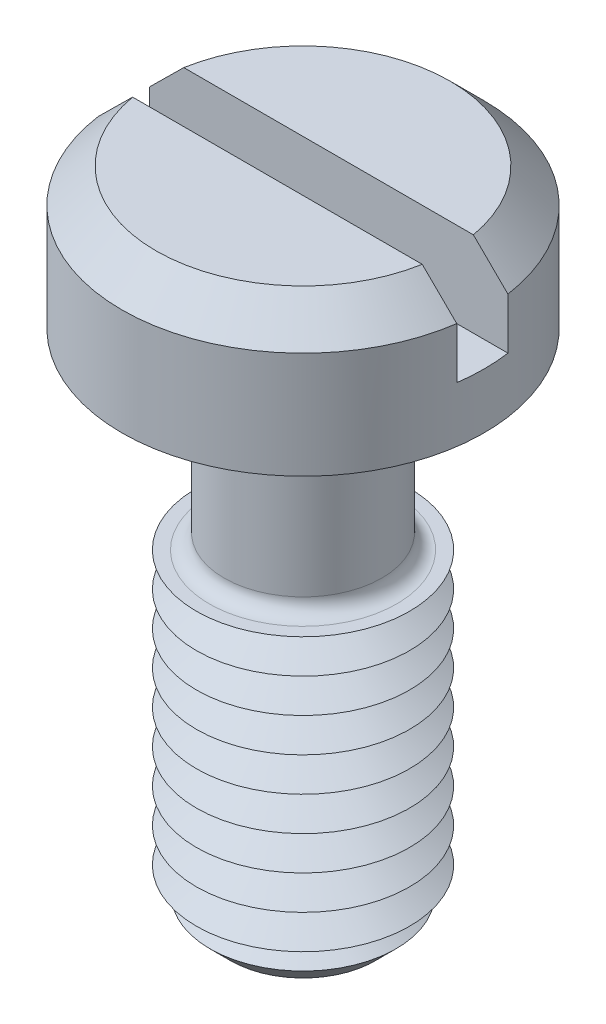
ISO-10303-21;
HEADER;
FILE_DESCRIPTION(('STEP AP214'),'2;1');
FILE_NAME('part.step','',(''),(''),'','','');
FILE_SCHEMA(('AUTOMOTIVE_DESIGN { 1 0 10303 214 1 1 1 1 }'));
ENDSEC;
DATA;
#1=APPLICATION_CONTEXT('core data for automotive mechanical design processes');
#2=APPLICATION_PROTOCOL_DEFINITION('international standard','automotive_design',2000,#1);
#3=PRODUCT_CONTEXT('',#1,'mechanical');
#4=PRODUCT('Part','Part','',(#3));
#5=PRODUCT_RELATED_PRODUCT_CATEGORY('part','',(#4));
#6=PRODUCT_DEFINITION_FORMATION('','',#4);
#7=PRODUCT_DEFINITION_CONTEXT('part definition',#1,'design');
#8=PRODUCT_DEFINITION('design','',#6,#7);
#9=PRODUCT_DEFINITION_SHAPE('','',#8);
#10=(LENGTH_UNIT() NAMED_UNIT(*) SI_UNIT(.MILLI.,.METRE.));
#11=(NAMED_UNIT(*) PLANE_ANGLE_UNIT() SI_UNIT($,.RADIAN.));
#12=(NAMED_UNIT(*) SI_UNIT($,.STERADIAN.) SOLID_ANGLE_UNIT());
#13=UNCERTAINTY_MEASURE_WITH_UNIT(LENGTH_MEASURE(1.E-05),#10,'distance_accuracy_value','');
#14=(GEOMETRIC_REPRESENTATION_CONTEXT(3) GLOBAL_UNCERTAINTY_ASSIGNED_CONTEXT((#13)) GLOBAL_UNIT_ASSIGNED_CONTEXT((#10,
#11,#12)) REPRESENTATION_CONTEXT('',''));
#15=CARTESIAN_POINT('',(0.,0.,0.));
#16=DIRECTION('',(0.,0.,1.));
#17=DIRECTION('',(1.,0.,0.));
#18=AXIS2_PLACEMENT_3D('',#15,#16,#17);
#19=CARTESIAN_POINT('',(0.,3.3,0.));
#20=DIRECTION('',(0.,1.,0.));
#21=DIRECTION('',(0.,0.,1.));
#22=AXIS2_PLACEMENT_3D('',#19,#20,#21);
#23=PLANE('',#22);
#24=DIRECTION('',(-1.,0.,0.));
#25=VECTOR('',#24,1.);
#26=CARTESIAN_POINT('',(4.25,3.3,-0.6));
#27=LINE('',#26,#25);
#28=CARTESIAN_POINT('',(3.39742549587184,3.3,-0.6));
#29=VERTEX_POINT('',#28);
#30=CARTESIAN_POINT('',(-3.39742549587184,3.3,-0.6));
#31=VERTEX_POINT('',#30);
#32=EDGE_CURVE('E110',#29,#31,#27,.T.);
#33=ORIENTED_EDGE('',*,*,#32,.F.);
#34=CARTESIAN_POINT('',(0.,3.3,0.));
#35=DIRECTION('',(0.,1.,0.));
#36=DIRECTION('',(0.,0.,1.));
#37=AXIS2_PLACEMENT_3D('',#34,#35,#36);
#38=CIRCLE('',#37,3.45);
#39=EDGE_CURVE('E113',#29,#31,#38,.T.);
#40=ORIENTED_EDGE('',*,*,#39,.T.);
#41=EDGE_LOOP('',(#33,#40));
#42=FACE_BOUND('',#41,.T.);
#43=ADVANCED_FACE('F39',(#42),#23,.T.);
#44=CARTESIAN_POINT('',(0.,3.3,0.));
#45=DIRECTION('',(0.,-1.,0.));
#46=DIRECTION('',(0.,0.,-1.));
#47=AXIS2_PLACEMENT_3D('',#44,#45,#46);
#48=CONICAL_SURFACE('',#47,3.45,0.785398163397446);
#49=CARTESIAN_POINT('',(9.35351408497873,-2.62273843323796,-0.6));
#50=CARTESIAN_POINT('',(9.03263557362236,-2.30252317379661,-0.6));
#51=CARTESIAN_POINT('',(8.71172811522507,-1.98233690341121,-0.6));
#52=CARTESIAN_POINT('',(8.06981262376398,-1.34205341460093,-0.6));
#53=CARTESIAN_POINT('',(7.74880458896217,-1.02195619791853,-0.6));
#54=CARTESIAN_POINT('',(7.10652460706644,-0.381761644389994,-0.6));
#55=CARTESIAN_POINT('',(6.7852526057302,-0.0616643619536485,-0.6));
#56=CARTESIAN_POINT('',(6.14251393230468,0.578323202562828,-0.6));
#57=CARTESIAN_POINT('',(5.82104726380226,0.898213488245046,-0.6));
#58=CARTESIAN_POINT('',(5.17196209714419,1.5434750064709,-0.6));
#59=CARTESIAN_POINT('',(4.84433778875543,1.86884039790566,-0.6));
#60=CARTESIAN_POINT('',(4.35244442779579,2.35644593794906,-0.6));
#61=CARTESIAN_POINT('',(4.18839924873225,2.51891187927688,-0.6));
#62=CARTESIAN_POINT('',(3.86009606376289,2.84362679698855,-0.6));
#63=CARTESIAN_POINT('',(3.69583805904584,3.0058757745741,-0.6));
#64=CARTESIAN_POINT('',(3.36705354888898,3.33001661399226,-0.6));
#65=CARTESIAN_POINT('',(3.20252712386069,3.49190855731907,-0.6));
#66=CARTESIAN_POINT('',(2.87298689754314,3.81520272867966,-0.6));
#67=CARTESIAN_POINT('',(2.70797308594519,3.97660494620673,-0.6));
#68=CARTESIAN_POINT('',(2.37716903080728,4.29858210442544,-0.6));
#69=CARTESIAN_POINT('',(2.21137886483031,4.45915712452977,-0.6));
#70=CARTESIAN_POINT('',(1.96157219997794,4.69884609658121,-0.6));
#71=CARTESIAN_POINT('',(1.87811785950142,4.77854546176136,-0.6));
#72=CARTESIAN_POINT('',(1.71066064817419,4.93736532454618,-0.6));
#73=CARTESIAN_POINT('',(1.62665778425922,5.01648582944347,-0.6));
#74=CARTESIAN_POINT('',(1.49655488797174,5.13773269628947,-0.6));
#75=CARTESIAN_POINT('',(1.45074972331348,5.18017521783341,-0.6));
#76=CARTESIAN_POINT('',(1.35882119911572,5.26471614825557,-0.6));
#77=CARTESIAN_POINT('',(1.31269783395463,5.30681455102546,-0.6));
#78=CARTESIAN_POINT('',(1.22008852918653,5.39050695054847,-0.6));
#79=CARTESIAN_POINT('',(1.17360305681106,5.43210146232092,-0.6));
#80=CARTESIAN_POINT('',(1.08007401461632,5.51465347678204,-0.6));
#81=CARTESIAN_POINT('',(1.03303046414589,5.55561100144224,-0.6));
#82=CARTESIAN_POINT('',(0.919047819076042,5.65299331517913,-0.6));
#83=CARTESIAN_POINT('',(0.851738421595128,5.7089924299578,-0.6));
#84=CARTESIAN_POINT('',(0.748806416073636,5.79068526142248,-0.6));
#85=CARTESIAN_POINT('',(0.714125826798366,5.8175621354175,-0.6));
#86=CARTESIAN_POINT('',(0.643915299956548,5.87018079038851,-0.6));
#87=CARTESIAN_POINT('',(0.608385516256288,5.89592277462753,-0.6));
#88=CARTESIAN_POINT('',(0.545162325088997,5.93955652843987,-0.6));
#89=CARTESIAN_POINT('',(0.51771851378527,5.95780799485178,-0.6));
#90=CARTESIAN_POINT('',(0.462025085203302,5.99303174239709,-0.6));
#91=CARTESIAN_POINT('',(0.433775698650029,6.01000438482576,-0.6));
#92=CARTESIAN_POINT('',(0.37634195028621,6.04213837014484,-0.6));
#93=CARTESIAN_POINT('',(0.347160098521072,6.05730412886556,-0.6));
#94=CARTESIAN_POINT('',(0.287642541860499,6.08513394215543,-0.6));
#95=CARTESIAN_POINT('',(0.257308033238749,6.09780051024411,-0.6));
#96=CARTESIAN_POINT('',(0.190863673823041,6.12124627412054,-0.6));
#97=CARTESIAN_POINT('',(0.154554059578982,6.13148571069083,-0.6));
#98=CARTESIAN_POINT('',(0.0807909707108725,6.14565404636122,-0.6));
#99=CARTESIAN_POINT('',(0.0433423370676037,6.14960664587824,-0.6));
#100=CARTESIAN_POINT('',(-0.0317987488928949,6.15033783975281,-0.6));
#101=CARTESIAN_POINT('',(-0.0694915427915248,6.14708428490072,-0.6));
#102=CARTESIAN_POINT('',(-0.143790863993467,6.13410921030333,-0.6));
#103=CARTESIAN_POINT('',(-0.180393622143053,6.12436747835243,-0.6));
#104=CARTESIAN_POINT('',(-0.254098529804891,6.09939647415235,-0.6));
#105=CARTESIAN_POINT('',(-0.291094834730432,6.08386859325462,-0.6));
#106=CARTESIAN_POINT('',(-0.363408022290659,6.04924663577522,-0.6));
#107=CARTESIAN_POINT('',(-0.398721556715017,6.03014579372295,-0.6));
#108=CARTESIAN_POINT('',(-0.468234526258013,5.98944452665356,-0.6));
#109=CARTESIAN_POINT('',(-0.50242270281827,5.96782521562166,-0.6));
#110=CARTESIAN_POINT('',(-0.569689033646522,5.92300618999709,-0.6));
#111=CARTESIAN_POINT('',(-0.602768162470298,5.89980792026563,-0.6));
#112=CARTESIAN_POINT('',(-0.671148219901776,5.85008963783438,-0.6));
#113=CARTESIAN_POINT('',(-0.706369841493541,5.82346130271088,-0.6));
#114=CARTESIAN_POINT('',(-0.776087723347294,5.76926828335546,-0.6));
#115=CARTESIAN_POINT('',(-0.810583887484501,5.74170347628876,-0.6));
#116=CARTESIAN_POINT('',(-0.913286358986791,5.65798278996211,-0.6));
#117=CARTESIAN_POINT('',(-0.980673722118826,5.60082541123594,-0.6));
#118=CARTESIAN_POINT('',(-1.11424616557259,5.48490670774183,-0.6));
#119=CARTESIAN_POINT('',(-1.18042891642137,5.42614273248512,-0.6));
#120=CARTESIAN_POINT('',(-1.31191262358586,5.30767463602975,-0.6));
#121=CARTESIAN_POINT('',(-1.37721382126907,5.24797078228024,-0.6));
#122=CARTESIAN_POINT('',(-1.50701089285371,5.12812906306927,-0.6));
#123=CARTESIAN_POINT('',(-1.57150872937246,5.06799331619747,-0.6));
#124=CARTESIAN_POINT('',(-1.70009132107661,4.94727328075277,-0.6));
#125=CARTESIAN_POINT('',(-1.76417604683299,4.88668896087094,-0.6));
#126=CARTESIAN_POINT('',(-1.95584105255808,4.70458824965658,-0.6));
#127=CARTESIAN_POINT('',(-2.08296922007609,4.5825964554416,-0.6));
#128=CARTESIAN_POINT('',(-2.33599178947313,4.33840625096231,-0.6));
#129=CARTESIAN_POINT('',(-2.4618891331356,4.21621087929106,-0.6));
#130=CARTESIAN_POINT('',(-2.71323511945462,3.97135925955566,-0.6));
#131=CARTESIAN_POINT('',(-2.83868376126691,3.84870301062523,-0.6));
#132=CARTESIAN_POINT('',(-3.21459106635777,3.48027743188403,-0.6));
#133=CARTESIAN_POINT('',(-3.46460626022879,3.23405597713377,-0.6));
#134=CARTESIAN_POINT('',(-3.96413793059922,2.74090313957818,-0.6));
#135=CARTESIAN_POINT('',(-4.21365415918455,2.49397150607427,-0.6));
#136=CARTESIAN_POINT('',(-4.71232475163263,1.99974737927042,-0.6));
#137=CARTESIAN_POINT('',(-4.96147911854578,1.75245488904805,-0.6));
#138=CARTESIAN_POINT('',(-5.45958725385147,1.25761544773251,-0.6));
#139=CARTESIAN_POINT('',(-5.70854099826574,1.01006847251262,-0.6));
#140=CARTESIAN_POINT('',(-6.20629498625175,0.514819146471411,-0.6));
#141=CARTESIAN_POINT('',(-6.45509522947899,0.26711679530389,-0.6));
#142=CARTESIAN_POINT('',(-7.20128563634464,-0.476100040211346,-0.6));
#143=CARTESIAN_POINT('',(-7.69851620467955,-0.971774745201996,-0.6));
#144=CARTESIAN_POINT('',(-8.38865115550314,-1.66007026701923,-0.6));
#145=CARTESIAN_POINT('',(-8.58165346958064,-1.85259293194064,-0.6));
#146=CARTESIAN_POINT('',(-8.87112736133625,-2.14139225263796,-0.6));
#147=CARTESIAN_POINT('',(-8.96761014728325,-2.23765767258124,-0.6));
#148=CARTESIAN_POINT('',(-9.16056764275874,-2.4301938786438,-0.6));
#149=CARTESIAN_POINT('',(-9.25704235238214,-2.52646466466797,-0.6));
#150=CARTESIAN_POINT('',(-9.35351408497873,-2.62273843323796,-0.6));
#151=B_SPLINE_CURVE_WITH_KNOTS('',3,(#49,#50,#51,#52,#53,#54,#55,#56,#57,#58,#59,#60,#61,#62,
#63,#64,#65,#66,#67,#68,#69,#70,#71,#72,#73,#74,#75,#76,#77,#78,#79,#80,#81,#82,#83,#84,#85,#86,
#87,#88,#89,#90,#91,#92,#93,#94,#95,#96,#97,#98,#99,#100,#101,#102,#103,#104,#105,#106,#107,
#108,#109,#110,#111,#112,#113,#114,#115,#116,#117,#118,#119,#120,#121,#122,#123,#124,#125,#126,
#127,#128,#129,#130,#131,#132,#133,#134,#135,#136,#137,#138,#139,#140,#141,#142,#143,#144,#145,
#146,#147,#148,#149,#150),.UNSPECIFIED.,.F.,.F.,(4,2,2,2,2,2,2,2,2,2,2,2,2,2,2,2,2,2,2,2,2,2,2,
2,2,2,2,2,2,2,2,2,2,2,2,2,2,2,2,2,2,2,2,2,2,2,2,2,2,2,4),(0.,1.35996600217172,2.71995696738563,
4.08050889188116,5.44103646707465,6.82624457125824,7.51888721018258,8.21152599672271,
8.90398568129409,9.59646011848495,10.288866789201,10.635058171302,10.9812451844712,
11.1685812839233,11.3559207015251,11.5430489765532,11.7301707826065,11.9927784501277,
12.1243921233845,12.2559821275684,12.3548333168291,12.4536564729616,12.5522329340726,
12.6507097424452,12.763461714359,12.8757876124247,12.9886156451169,13.101796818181,
13.2218851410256,13.3422031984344,13.4634899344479,13.584667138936,13.7171086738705,
13.8495676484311,14.1146090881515,14.3801178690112,14.6455524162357,14.910099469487,
15.17466516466,15.7032346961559,16.2295761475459,16.7559185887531,17.8086237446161,
18.8617626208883,19.9148925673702,20.9681337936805,22.0213773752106,24.1276499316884,
24.9454725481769,25.354353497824,25.7632286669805),.UNSPECIFIED.);
#152=CARTESIAN_POINT('',(4.20743389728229,2.5,-0.6));
#153=VERTEX_POINT('',#152);
#154=EDGE_CURVE('E267',#153,#29,#151,.T.);
#155=ORIENTED_EDGE('',*,*,#154,.F.);
#156=CARTESIAN_POINT('',(0.,2.5,0.));
#157=DIRECTION('',(0.,1.,0.));
#158=DIRECTION('',(0.,0.,1.));
#159=AXIS2_PLACEMENT_3D('',#156,#157,#158);
#160=CIRCLE('',#159,4.25);
#161=CARTESIAN_POINT('',(-4.20743389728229,2.5,-0.6));
#162=VERTEX_POINT('',#161);
#163=EDGE_CURVE('E127',#162,#153,#160,.F.);
#164=ORIENTED_EDGE('',*,*,#163,.F.);
#165=EDGE_CURVE('E102',#31,#162,#151,.T.);
#166=ORIENTED_EDGE('',*,*,#165,.F.);
#167=ORIENTED_EDGE('',*,*,#39,.F.);
#168=EDGE_LOOP('',(#155,#164,#166,#167));
#169=FACE_BOUND('',#168,.T.);
#170=ADVANCED_FACE('F229',(#169),#48,.T.);
#171=CARTESIAN_POINT('',(0.,-12.,0.));
#172=DIRECTION('',(0.,1.,0.));
#173=DIRECTION('',(0.,0.,1.));
#174=AXIS2_PLACEMENT_3D('',#171,#172,#173);
#175=CYLINDRICAL_SURFACE('',#174,1.85);
#176=CARTESIAN_POINT('',(0.,-4.15,0.));
#177=DIRECTION('',(0.,-1.,0.));
#178=DIRECTION('',(0.,0.,-1.));
#179=AXIS2_PLACEMENT_3D('',#176,#177,#178);
#180=CIRCLE('',#179,1.85);
#181=CARTESIAN_POINT('',(0.,-4.15,-1.85));
#182=VERTEX_POINT('',#181);
#183=EDGE_CURVE('E122',#182,#182,#180,.F.);
#184=ORIENTED_EDGE('',*,*,#183,.T.);
#185=EDGE_LOOP('',(#184));
#186=FACE_BOUND('',#185,.T.);
#187=CARTESIAN_POINT('',(0.,-0.35,0.));
#188=DIRECTION('',(0.,1.,0.));
#189=DIRECTION('',(0.,0.,1.));
#190=AXIS2_PLACEMENT_3D('',#187,#188,#189);
#191=CIRCLE('',#190,1.85);
#192=CARTESIAN_POINT('',(0.,-0.35,1.85));
#193=VERTEX_POINT('',#192);
#194=EDGE_CURVE('E382',#193,#193,#191,.F.);
#195=ORIENTED_EDGE('',*,*,#194,.T.);
#196=EDGE_LOOP('',(#195));
#197=FACE_BOUND('',#196,.T.);
#198=ADVANCED_FACE('F225',(#186,#197),#175,.T.);
#199=CARTESIAN_POINT('',(0.,3.3,0.));
#200=DIRECTION('',(0.,-1.,0.));
#201=DIRECTION('',(0.,0.,-1.));
#202=AXIS2_PLACEMENT_3D('',#199,#200,#201);
#203=CYLINDRICAL_SURFACE('',#202,4.25);
#204=ORIENTED_EDGE('',*,*,#163,.T.);
#205=DIRECTION('',(0.,-1.,0.));
#206=VECTOR('',#205,1.);
#207=CARTESIAN_POINT('',(4.20743389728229,3.3,-0.6));
#208=LINE('',#207,#206);
#209=CARTESIAN_POINT('',(4.20743389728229,1.3,-0.6));
#210=VERTEX_POINT('',#209);
#211=EDGE_CURVE('E64',#153,#210,#208,.T.);
#212=ORIENTED_EDGE('',*,*,#211,.T.);
#213=CARTESIAN_POINT('',(0.,1.3,0.));
#214=DIRECTION('',(0.,1.,0.));
#215=DIRECTION('',(0.,0.,1.));
#216=AXIS2_PLACEMENT_3D('',#213,#214,#215);
#217=CIRCLE('',#216,4.25);
#218=CARTESIAN_POINT('',(4.20743389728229,1.3,0.6));
#219=VERTEX_POINT('',#218);
#220=EDGE_CURVE('E11',#219,#210,#217,.T.);
#221=ORIENTED_EDGE('',*,*,#220,.F.);
#222=DIRECTION('',(0.,-1.,0.));
#223=VECTOR('',#222,1.);
#224=CARTESIAN_POINT('',(4.20743389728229,3.3,0.6));
#225=LINE('',#224,#223);
#226=CARTESIAN_POINT('',(4.20743389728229,2.5,0.6));
#227=VERTEX_POINT('',#226);
#228=EDGE_CURVE('E285',#219,#227,#225,.F.);
#229=ORIENTED_EDGE('',*,*,#228,.T.);
#230=CARTESIAN_POINT('',(-4.20743389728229,2.5,0.6));
#231=VERTEX_POINT('',#230);
#232=EDGE_CURVE('E119',#227,#231,#160,.F.);
#233=ORIENTED_EDGE('',*,*,#232,.T.);
#234=DIRECTION('',(0.,-1.,0.));
#235=VECTOR('',#234,1.);
#236=CARTESIAN_POINT('',(-4.20743389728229,3.3,0.6));
#237=LINE('',#236,#235);
#238=CARTESIAN_POINT('',(-4.20743389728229,1.3,0.6));
#239=VERTEX_POINT('',#238);
#240=EDGE_CURVE('E96',#231,#239,#237,.T.);
#241=ORIENTED_EDGE('',*,*,#240,.T.);
#242=CARTESIAN_POINT('',(-4.20743389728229,1.3,-0.6));
#243=VERTEX_POINT('',#242);
#244=EDGE_CURVE('E44',#243,#239,#217,.T.);
#245=ORIENTED_EDGE('',*,*,#244,.F.);
#246=DIRECTION('',(0.,-1.,0.));
#247=VECTOR('',#246,1.);
#248=CARTESIAN_POINT('',(-4.20743389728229,3.3,-0.6));
#249=LINE('',#248,#247);
#250=EDGE_CURVE('E289',#243,#162,#249,.F.);
#251=ORIENTED_EDGE('',*,*,#250,.T.);
#252=EDGE_LOOP('',(#204,#212,#221,#229,#233,#241,#245,#251));
#253=FACE_BOUND('',#252,.T.);
#254=CARTESIAN_POINT('',(0.,0.,0.));
#255=DIRECTION('',(0.,1.,0.));
#256=DIRECTION('',(0.,0.,1.));
#257=AXIS2_PLACEMENT_3D('',#254,#255,#256);
#258=CIRCLE('',#257,4.25);
#259=CARTESIAN_POINT('',(0.,0.,4.25));
#260=VERTEX_POINT('',#259);
#261=EDGE_CURVE('E368',#260,#260,#258,.T.);
#262=ORIENTED_EDGE('',*,*,#261,.T.);
#263=EDGE_LOOP('',(#262));
#264=FACE_BOUND('',#263,.T.);
#265=ADVANCED_FACE('F228',(#253,#264),#203,.T.);
#266=DIRECTION('',(1.,0.,0.));
#267=VECTOR('',#266,1.);
#268=CARTESIAN_POINT('',(4.25,3.3,0.6));
#269=LINE('',#268,#267);
#270=CARTESIAN_POINT('',(-3.39742549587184,3.3,0.6));
#271=VERTEX_POINT('',#270);
#272=CARTESIAN_POINT('',(3.39742549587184,3.3,0.6));
#273=VERTEX_POINT('',#272);
#274=EDGE_CURVE('E56',#271,#273,#269,.T.);
#275=ORIENTED_EDGE('',*,*,#274,.F.);
#276=EDGE_CURVE('E108',#271,#273,#38,.T.);
#277=ORIENTED_EDGE('',*,*,#276,.T.);
#278=EDGE_LOOP('',(#275,#277));
#279=FACE_BOUND('',#278,.T.);
#280=ADVANCED_FACE('F107',(#279),#23,.T.);
#281=CARTESIAN_POINT('',(0.,0.,0.));
#282=DIRECTION('',(0.,1.,0.));
#283=DIRECTION('',(0.,0.,1.));
#284=AXIS2_PLACEMENT_3D('',#281,#282,#283);
#285=PLANE('',#284);
#286=CARTESIAN_POINT('',(0.,0.,0.));
#287=DIRECTION('',(0.,1.,0.));
#288=DIRECTION('',(0.,0.,1.));
#289=AXIS2_PLACEMENT_3D('',#286,#287,#288);
#290=CIRCLE('',#289,2.2);
#291=CARTESIAN_POINT('',(0.,0.,2.2));
#292=VERTEX_POINT('',#291);
#293=EDGE_CURVE('E114',#292,#292,#290,.T.);
#294=ORIENTED_EDGE('',*,*,#293,.T.);
#295=EDGE_LOOP('',(#294));
#296=FACE_BOUND('',#295,.T.);
#297=ORIENTED_EDGE('',*,*,#261,.F.);
#298=EDGE_LOOP('',(#297));
#299=FACE_BOUND('',#298,.T.);
#300=ADVANCED_FACE('F219',(#296,#299),#285,.F.);
#301=CARTESIAN_POINT('',(0.,-4.5,0.));
#302=DIRECTION('',(0.,-1.,0.));
#303=DIRECTION('',(0.,0.,-1.));
#304=AXIS2_PLACEMENT_3D('',#301,#302,#303);
#305=PLANE('',#304);
#306=CARTESIAN_POINT('',(0.,-4.5,0.));
#307=DIRECTION('',(0.,-1.,0.));
#308=DIRECTION('',(0.,0.,-1.));
#309=AXIS2_PLACEMENT_3D('',#306,#307,#308);
#310=CIRCLE('',#309,2.2);
#311=CARTESIAN_POINT('',(0.,-4.5,-2.2));
#312=VERTEX_POINT('',#311);
#313=EDGE_CURVE('E376',#312,#312,#310,.T.);
#314=ORIENTED_EDGE('',*,*,#313,.T.);
#315=EDGE_LOOP('',(#314));
#316=FACE_BOUND('',#315,.T.);
#317=CARTESIAN_POINT('',(0.,-4.5,0.));
#318=DIRECTION('',(0.,1.,0.));
#319=DIRECTION('',(0.,0.,1.));
#320=AXIS2_PLACEMENT_3D('',#317,#318,#319);
#321=CIRCLE('',#320,2.5);
#322=CARTESIAN_POINT('',(0.,-4.5,2.5));
#323=VERTEX_POINT('',#322);
#324=EDGE_CURVE('E364',#323,#323,#321,.T.);
#325=ORIENTED_EDGE('',*,*,#324,.T.);
#326=EDGE_LOOP('',(#325));
#327=FACE_BOUND('',#326,.T.);
#328=ADVANCED_FACE('F215',(#316,#327),#305,.F.);
#329=CARTESIAN_POINT('',(0.,-4.9,0.));
#330=DIRECTION('',(0.,1.,0.));
#331=DIRECTION('',(0.,0.,1.));
#332=AXIS2_PLACEMENT_3D('',#329,#330,#331);
#333=CONICAL_SURFACE('',#332,1.80717967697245,1.0471975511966);
#334=ORIENTED_EDGE('',*,*,#324,.F.);
#335=EDGE_LOOP('',(#334));
#336=FACE_BOUND('',#335,.T.);
#337=CARTESIAN_POINT('',(0.,-4.9,0.));
#338=DIRECTION('',(0.,1.,0.));
#339=DIRECTION('',(0.,0.,1.));
#340=AXIS2_PLACEMENT_3D('',#337,#338,#339);
#341=CIRCLE('',#340,1.80717967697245);
#342=CARTESIAN_POINT('',(0.,-4.9,1.80717967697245));
#343=VERTEX_POINT('',#342);
#344=EDGE_CURVE('E360',#343,#343,#341,.T.);
#345=ORIENTED_EDGE('',*,*,#344,.T.);
#346=EDGE_LOOP('',(#345));
#347=FACE_BOUND('',#346,.T.);
#348=ADVANCED_FACE('F211',(#336,#347),#333,.T.);
#349=CARTESIAN_POINT('',(0.,-5.3,0.));
#350=DIRECTION('',(0.,-1.,0.));
#351=DIRECTION('',(0.,0.,-1.));
#352=AXIS2_PLACEMENT_3D('',#349,#350,#351);
#353=CONICAL_SURFACE('',#352,2.5,1.0471975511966);
#354=ORIENTED_EDGE('',*,*,#344,.F.);
#355=EDGE_LOOP('',(#354));
#356=FACE_BOUND('',#355,.T.);
#357=CARTESIAN_POINT('',(0.,-5.3,0.));
#358=DIRECTION('',(0.,1.,0.));
#359=DIRECTION('',(0.,0.,1.));
#360=AXIS2_PLACEMENT_3D('',#357,#358,#359);
#361=CIRCLE('',#360,2.5);
#362=CARTESIAN_POINT('',(0.,-5.3,2.5));
#363=VERTEX_POINT('',#362);
#364=EDGE_CURVE('E357',#363,#363,#361,.T.);
#365=ORIENTED_EDGE('',*,*,#364,.T.);
#366=EDGE_LOOP('',(#365));
#367=FACE_BOUND('',#366,.T.);
#368=ADVANCED_FACE('F207',(#356,#367),#353,.T.);
#369=CARTESIAN_POINT('',(0.,-5.7,0.));
#370=DIRECTION('',(0.,1.,0.));
#371=DIRECTION('',(0.,0.,1.));
#372=AXIS2_PLACEMENT_3D('',#369,#370,#371);
#373=CONICAL_SURFACE('',#372,1.80717967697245,1.0471975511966);
#374=ORIENTED_EDGE('',*,*,#364,.F.);
#375=EDGE_LOOP('',(#374));
#376=FACE_BOUND('',#375,.T.);
#377=CARTESIAN_POINT('',(0.,-5.7,0.));
#378=DIRECTION('',(0.,1.,0.));
#379=DIRECTION('',(0.,0.,1.));
#380=AXIS2_PLACEMENT_3D('',#377,#378,#379);
#381=CIRCLE('',#380,1.80717967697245);
#382=CARTESIAN_POINT('',(0.,-5.7,1.80717967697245));
#383=VERTEX_POINT('',#382);
#384=EDGE_CURVE('E353',#383,#383,#381,.T.);
#385=ORIENTED_EDGE('',*,*,#384,.T.);
#386=EDGE_LOOP('',(#385));
#387=FACE_BOUND('',#386,.T.);
#388=ADVANCED_FACE('F203',(#376,#387),#373,.T.);
#389=CARTESIAN_POINT('',(0.,-6.1,0.));
#390=DIRECTION('',(0.,-1.,0.));
#391=DIRECTION('',(0.,0.,-1.));
#392=AXIS2_PLACEMENT_3D('',#389,#390,#391);
#393=CONICAL_SURFACE('',#392,2.5,1.0471975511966);
#394=ORIENTED_EDGE('',*,*,#384,.F.);
#395=EDGE_LOOP('',(#394));
#396=FACE_BOUND('',#395,.T.);
#397=CARTESIAN_POINT('',(0.,-6.1,0.));
#398=DIRECTION('',(0.,1.,0.));
#399=DIRECTION('',(0.,0.,1.));
#400=AXIS2_PLACEMENT_3D('',#397,#398,#399);
#401=CIRCLE('',#400,2.5);
#402=CARTESIAN_POINT('',(0.,-6.1,2.5));
#403=VERTEX_POINT('',#402);
#404=EDGE_CURVE('E349',#403,#403,#401,.T.);
#405=ORIENTED_EDGE('',*,*,#404,.T.);
#406=EDGE_LOOP('',(#405));
#407=FACE_BOUND('',#406,.T.);
#408=ADVANCED_FACE('F199',(#396,#407),#393,.T.);
#409=CARTESIAN_POINT('',(0.,-6.5,0.));
#410=DIRECTION('',(0.,1.,0.));
#411=DIRECTION('',(0.,0.,1.));
#412=AXIS2_PLACEMENT_3D('',#409,#410,#411);
#413=CONICAL_SURFACE('',#412,1.80717967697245,1.0471975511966);
#414=ORIENTED_EDGE('',*,*,#404,.F.);
#415=EDGE_LOOP('',(#414));
#416=FACE_BOUND('',#415,.T.);
#417=CARTESIAN_POINT('',(0.,-6.5,0.));
#418=DIRECTION('',(0.,1.,0.));
#419=DIRECTION('',(0.,0.,1.));
#420=AXIS2_PLACEMENT_3D('',#417,#418,#419);
#421=CIRCLE('',#420,1.80717967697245);
#422=CARTESIAN_POINT('',(0.,-6.5,1.80717967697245));
#423=VERTEX_POINT('',#422);
#424=EDGE_CURVE('E346',#423,#423,#421,.T.);
#425=ORIENTED_EDGE('',*,*,#424,.T.);
#426=EDGE_LOOP('',(#425));
#427=FACE_BOUND('',#426,.T.);
#428=ADVANCED_FACE('F195',(#416,#427),#413,.T.);
#429=CARTESIAN_POINT('',(0.,-6.9,0.));
#430=DIRECTION('',(0.,-1.,0.));
#431=DIRECTION('',(0.,0.,-1.));
#432=AXIS2_PLACEMENT_3D('',#429,#430,#431);
#433=CONICAL_SURFACE('',#432,2.5,1.0471975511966);
#434=ORIENTED_EDGE('',*,*,#424,.F.);
#435=EDGE_LOOP('',(#434));
#436=FACE_BOUND('',#435,.T.);
#437=CARTESIAN_POINT('',(0.,-6.9,0.));
#438=DIRECTION('',(0.,1.,0.));
#439=DIRECTION('',(0.,0.,1.));
#440=AXIS2_PLACEMENT_3D('',#437,#438,#439);
#441=CIRCLE('',#440,2.5);
#442=CARTESIAN_POINT('',(0.,-6.9,2.5));
#443=VERTEX_POINT('',#442);
#444=EDGE_CURVE('E342',#443,#443,#441,.T.);
#445=ORIENTED_EDGE('',*,*,#444,.T.);
#446=EDGE_LOOP('',(#445));
#447=FACE_BOUND('',#446,.T.);
#448=ADVANCED_FACE('F191',(#436,#447),#433,.T.);
#449=CARTESIAN_POINT('',(0.,-7.3,0.));
#450=DIRECTION('',(0.,1.,0.));
#451=DIRECTION('',(0.,0.,1.));
#452=AXIS2_PLACEMENT_3D('',#449,#450,#451);
#453=CONICAL_SURFACE('',#452,1.80717967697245,1.0471975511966);
#454=ORIENTED_EDGE('',*,*,#444,.F.);
#455=EDGE_LOOP('',(#454));
#456=FACE_BOUND('',#455,.T.);
#457=CARTESIAN_POINT('',(0.,-7.3,0.));
#458=DIRECTION('',(0.,1.,0.));
#459=DIRECTION('',(0.,0.,1.));
#460=AXIS2_PLACEMENT_3D('',#457,#458,#459);
#461=CIRCLE('',#460,1.80717967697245);
#462=CARTESIAN_POINT('',(0.,-7.3,1.80717967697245));
#463=VERTEX_POINT('',#462);
#464=EDGE_CURVE('E338',#463,#463,#461,.T.);
#465=ORIENTED_EDGE('',*,*,#464,.T.);
#466=EDGE_LOOP('',(#465));
#467=FACE_BOUND('',#466,.T.);
#468=ADVANCED_FACE('F187',(#456,#467),#453,.T.);
#469=CARTESIAN_POINT('',(0.,-7.7,0.));
#470=DIRECTION('',(0.,-1.,0.));
#471=DIRECTION('',(0.,0.,-1.));
#472=AXIS2_PLACEMENT_3D('',#469,#470,#471);
#473=CONICAL_SURFACE('',#472,2.5,1.0471975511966);
#474=ORIENTED_EDGE('',*,*,#464,.F.);
#475=EDGE_LOOP('',(#474));
#476=FACE_BOUND('',#475,.T.);
#477=CARTESIAN_POINT('',(0.,-7.7,0.));
#478=DIRECTION('',(0.,1.,0.));
#479=DIRECTION('',(0.,0.,1.));
#480=AXIS2_PLACEMENT_3D('',#477,#478,#479);
#481=CIRCLE('',#480,2.5);
#482=CARTESIAN_POINT('',(0.,-7.7,2.5));
#483=VERTEX_POINT('',#482);
#484=EDGE_CURVE('E335',#483,#483,#481,.T.);
#485=ORIENTED_EDGE('',*,*,#484,.T.);
#486=EDGE_LOOP('',(#485));
#487=FACE_BOUND('',#486,.T.);
#488=ADVANCED_FACE('F183',(#476,#487),#473,.T.);
#489=CARTESIAN_POINT('',(0.,-8.1,0.));
#490=DIRECTION('',(0.,1.,0.));
#491=DIRECTION('',(0.,0.,1.));
#492=AXIS2_PLACEMENT_3D('',#489,#490,#491);
#493=CONICAL_SURFACE('',#492,1.80717967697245,1.0471975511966);
#494=ORIENTED_EDGE('',*,*,#484,.F.);
#495=EDGE_LOOP('',(#494));
#496=FACE_BOUND('',#495,.T.);
#497=CARTESIAN_POINT('',(0.,-8.1,0.));
#498=DIRECTION('',(0.,1.,0.));
#499=DIRECTION('',(0.,0.,1.));
#500=AXIS2_PLACEMENT_3D('',#497,#498,#499);
#501=CIRCLE('',#500,1.80717967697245);
#502=CARTESIAN_POINT('',(0.,-8.1,1.80717967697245));
#503=VERTEX_POINT('',#502);
#504=EDGE_CURVE('E331',#503,#503,#501,.T.);
#505=ORIENTED_EDGE('',*,*,#504,.T.);
#506=EDGE_LOOP('',(#505));
#507=FACE_BOUND('',#506,.T.);
#508=ADVANCED_FACE('F179',(#496,#507),#493,.T.);
#509=CARTESIAN_POINT('',(0.,-8.5,0.));
#510=DIRECTION('',(0.,-1.,0.));
#511=DIRECTION('',(0.,0.,-1.));
#512=AXIS2_PLACEMENT_3D('',#509,#510,#511);
#513=CONICAL_SURFACE('',#512,2.5,1.0471975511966);
#514=ORIENTED_EDGE('',*,*,#504,.F.);
#515=EDGE_LOOP('',(#514));
#516=FACE_BOUND('',#515,.T.);
#517=CARTESIAN_POINT('',(0.,-8.5,0.));
#518=DIRECTION('',(0.,1.,0.));
#519=DIRECTION('',(0.,0.,1.));
#520=AXIS2_PLACEMENT_3D('',#517,#518,#519);
#521=CIRCLE('',#520,2.5);
#522=CARTESIAN_POINT('',(0.,-8.5,2.5));
#523=VERTEX_POINT('',#522);
#524=EDGE_CURVE('E327',#523,#523,#521,.T.);
#525=ORIENTED_EDGE('',*,*,#524,.T.);
#526=EDGE_LOOP('',(#525));
#527=FACE_BOUND('',#526,.T.);
#528=ADVANCED_FACE('F175',(#516,#527),#513,.T.);
#529=CARTESIAN_POINT('',(0.,-8.9,0.));
#530=DIRECTION('',(0.,1.,0.));
#531=DIRECTION('',(0.,0.,1.));
#532=AXIS2_PLACEMENT_3D('',#529,#530,#531);
#533=CONICAL_SURFACE('',#532,1.80717967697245,1.0471975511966);
#534=ORIENTED_EDGE('',*,*,#524,.F.);
#535=EDGE_LOOP('',(#534));
#536=FACE_BOUND('',#535,.T.);
#537=CARTESIAN_POINT('',(0.,-8.9,0.));
#538=DIRECTION('',(0.,1.,0.));
#539=DIRECTION('',(0.,0.,1.));
#540=AXIS2_PLACEMENT_3D('',#537,#538,#539);
#541=CIRCLE('',#540,1.80717967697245);
#542=CARTESIAN_POINT('',(0.,-8.9,1.80717967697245));
#543=VERTEX_POINT('',#542);
#544=EDGE_CURVE('E323',#543,#543,#541,.T.);
#545=ORIENTED_EDGE('',*,*,#544,.T.);
#546=EDGE_LOOP('',(#545));
#547=FACE_BOUND('',#546,.T.);
#548=ADVANCED_FACE('F171',(#536,#547),#533,.T.);
#549=CARTESIAN_POINT('',(0.,-9.3,0.));
#550=DIRECTION('',(0.,-1.,0.));
#551=DIRECTION('',(0.,0.,-1.));
#552=AXIS2_PLACEMENT_3D('',#549,#550,#551);
#553=CONICAL_SURFACE('',#552,2.5,1.0471975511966);
#554=ORIENTED_EDGE('',*,*,#544,.F.);
#555=EDGE_LOOP('',(#554));
#556=FACE_BOUND('',#555,.T.);
#557=CARTESIAN_POINT('',(0.,-9.3,0.));
#558=DIRECTION('',(0.,1.,0.));
#559=DIRECTION('',(0.,0.,1.));
#560=AXIS2_PLACEMENT_3D('',#557,#558,#559);
#561=CIRCLE('',#560,2.5);
#562=CARTESIAN_POINT('',(0.,-9.3,2.5));
#563=VERTEX_POINT('',#562);
#564=EDGE_CURVE('E319',#563,#563,#561,.T.);
#565=ORIENTED_EDGE('',*,*,#564,.T.);
#566=EDGE_LOOP('',(#565));
#567=FACE_BOUND('',#566,.T.);
#568=ADVANCED_FACE('F167',(#556,#567),#553,.T.);
#569=CARTESIAN_POINT('',(0.,-9.7,0.));
#570=DIRECTION('',(0.,1.,0.));
#571=DIRECTION('',(0.,0.,1.));
#572=AXIS2_PLACEMENT_3D('',#569,#570,#571);
#573=CONICAL_SURFACE('',#572,1.80717967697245,1.0471975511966);
#574=ORIENTED_EDGE('',*,*,#564,.F.);
#575=EDGE_LOOP('',(#574));
#576=FACE_BOUND('',#575,.T.);
#577=CARTESIAN_POINT('',(0.,-9.7,0.));
#578=DIRECTION('',(0.,1.,0.));
#579=DIRECTION('',(0.,0.,1.));
#580=AXIS2_PLACEMENT_3D('',#577,#578,#579);
#581=CIRCLE('',#580,1.80717967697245);
#582=CARTESIAN_POINT('',(0.,-9.7,1.80717967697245));
#583=VERTEX_POINT('',#582);
#584=EDGE_CURVE('E315',#583,#583,#581,.T.);
#585=ORIENTED_EDGE('',*,*,#584,.T.);
#586=EDGE_LOOP('',(#585));
#587=FACE_BOUND('',#586,.T.);
#588=ADVANCED_FACE('F163',(#576,#587),#573,.T.);
#589=CARTESIAN_POINT('',(0.,-10.1,0.));
#590=DIRECTION('',(0.,-1.,0.));
#591=DIRECTION('',(0.,0.,-1.));
#592=AXIS2_PLACEMENT_3D('',#589,#590,#591);
#593=CONICAL_SURFACE('',#592,2.5,1.0471975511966);
#594=ORIENTED_EDGE('',*,*,#584,.F.);
#595=EDGE_LOOP('',(#594));
#596=FACE_BOUND('',#595,.T.);
#597=CARTESIAN_POINT('',(0.,-10.1,0.));
#598=DIRECTION('',(0.,1.,0.));
#599=DIRECTION('',(0.,0.,1.));
#600=AXIS2_PLACEMENT_3D('',#597,#598,#599);
#601=CIRCLE('',#600,2.5);
#602=CARTESIAN_POINT('',(0.,-10.1,2.5));
#603=VERTEX_POINT('',#602);
#604=EDGE_CURVE('E311',#603,#603,#601,.T.);
#605=ORIENTED_EDGE('',*,*,#604,.T.);
#606=EDGE_LOOP('',(#605));
#607=FACE_BOUND('',#606,.T.);
#608=ADVANCED_FACE('F159',(#596,#607),#593,.T.);
#609=CARTESIAN_POINT('',(0.,-10.5,0.));
#610=DIRECTION('',(0.,1.,0.));
#611=DIRECTION('',(0.,0.,1.));
#612=AXIS2_PLACEMENT_3D('',#609,#610,#611);
#613=CONICAL_SURFACE('',#612,1.80717967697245,1.0471975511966);
#614=ORIENTED_EDGE('',*,*,#604,.F.);
#615=EDGE_LOOP('',(#614));
#616=FACE_BOUND('',#615,.T.);
#617=CARTESIAN_POINT('',(0.,-10.5,0.));
#618=DIRECTION('',(0.,1.,0.));
#619=DIRECTION('',(0.,0.,1.));
#620=AXIS2_PLACEMENT_3D('',#617,#618,#619);
#621=CIRCLE('',#620,1.80717967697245);
#622=CARTESIAN_POINT('',(0.,-10.5,1.80717967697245));
#623=VERTEX_POINT('',#622);
#624=EDGE_CURVE('E307',#623,#623,#621,.T.);
#625=ORIENTED_EDGE('',*,*,#624,.T.);
#626=EDGE_LOOP('',(#625));
#627=FACE_BOUND('',#626,.T.);
#628=ADVANCED_FACE('F155',(#616,#627),#613,.T.);
#629=CARTESIAN_POINT('',(0.,-10.9,0.));
#630=DIRECTION('',(0.,-1.,0.));
#631=DIRECTION('',(0.,0.,-1.));
#632=AXIS2_PLACEMENT_3D('',#629,#630,#631);
#633=CONICAL_SURFACE('',#632,2.5,1.0471975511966);
#634=ORIENTED_EDGE('',*,*,#624,.F.);
#635=EDGE_LOOP('',(#634));
#636=FACE_BOUND('',#635,.T.);
#637=CARTESIAN_POINT('',(0.,-10.9,0.));
#638=DIRECTION('',(0.,1.,0.));
#639=DIRECTION('',(0.,0.,1.));
#640=AXIS2_PLACEMENT_3D('',#637,#638,#639);
#641=CIRCLE('',#640,2.5);
#642=CARTESIAN_POINT('',(0.,-10.9,2.5));
#643=VERTEX_POINT('',#642);
#644=EDGE_CURVE('E303',#643,#643,#641,.T.);
#645=ORIENTED_EDGE('',*,*,#644,.T.);
#646=EDGE_LOOP('',(#645));
#647=FACE_BOUND('',#646,.T.);
#648=ADVANCED_FACE('F151',(#636,#647),#633,.T.);
#649=CARTESIAN_POINT('',(0.,-11.3,0.));
#650=DIRECTION('',(0.,1.,0.));
#651=DIRECTION('',(0.,0.,1.));
#652=AXIS2_PLACEMENT_3D('',#649,#650,#651);
#653=CONICAL_SURFACE('',#652,1.80717967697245,1.0471975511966);
#654=ORIENTED_EDGE('',*,*,#644,.F.);
#655=EDGE_LOOP('',(#654));
#656=FACE_BOUND('',#655,.T.);
#657=CARTESIAN_POINT('',(0.,-11.3,0.));
#658=DIRECTION('',(0.,1.,0.));
#659=DIRECTION('',(0.,0.,1.));
#660=AXIS2_PLACEMENT_3D('',#657,#658,#659);
#661=CIRCLE('',#660,1.80717967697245);
#662=CARTESIAN_POINT('',(0.,-11.3,1.80717967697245));
#663=VERTEX_POINT('',#662);
#664=EDGE_CURVE('E299',#663,#663,#661,.T.);
#665=ORIENTED_EDGE('',*,*,#664,.T.);
#666=EDGE_LOOP('',(#665));
#667=FACE_BOUND('',#666,.T.);
#668=ADVANCED_FACE('F147',(#656,#667),#653,.T.);
#669=CARTESIAN_POINT('',(0.,-11.7,0.));
#670=DIRECTION('',(0.,-1.,0.));
#671=DIRECTION('',(0.,0.,-1.));
#672=AXIS2_PLACEMENT_3D('',#669,#670,#671);
#673=CONICAL_SURFACE('',#672,2.5,1.0471975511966);
#674=CARTESIAN_POINT('',(0.,-11.5169872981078,0.));
#675=DIRECTION('',(0.,-1.,0.));
#676=DIRECTION('',(0.,0.,-1.));
#677=AXIS2_PLACEMENT_3D('',#674,#675,#676);
#678=CIRCLE('',#677,2.18301270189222);
#679=CARTESIAN_POINT('',(0.,-11.5169872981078,2.18301270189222));
#680=VERTEX_POINT('',#679);
#681=EDGE_CURVE('E306',#680,#680,#678,.F.);
#682=ORIENTED_EDGE('',*,*,#681,.T.);
#683=EDGE_LOOP('',(#682));
#684=FACE_BOUND('',#683,.T.);
#685=ORIENTED_EDGE('',*,*,#664,.F.);
#686=EDGE_LOOP('',(#685));
#687=FACE_BOUND('',#686,.T.);
#688=ADVANCED_FACE('F143',(#684,#687),#673,.T.);
#689=CARTESIAN_POINT('',(0.,-12.,0.));
#690=DIRECTION('',(0.,-1.,0.));
#691=DIRECTION('',(0.,0.,-1.));
#692=AXIS2_PLACEMENT_3D('',#689,#690,#691);
#693=PLANE('',#692);
#694=CARTESIAN_POINT('',(0.,-12.,0.));
#695=DIRECTION('',(0.,-1.,0.));
#696=DIRECTION('',(0.,0.,-1.));
#697=AXIS2_PLACEMENT_3D('',#694,#695,#696);
#698=CIRCLE('',#697,1.70000000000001);
#699=CARTESIAN_POINT('',(0.,-12.,1.70000000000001));
#700=VERTEX_POINT('',#699);
#701=EDGE_CURVE('E372',#700,#700,#698,.T.);
#702=ORIENTED_EDGE('',*,*,#701,.T.);
#703=EDGE_LOOP('',(#702));
#704=FACE_BOUND('',#703,.T.);
#705=ADVANCED_FACE('F146',(#704),#693,.T.);
#706=CARTESIAN_POINT('',(0.,-12.,0.));
#707=DIRECTION('',(0.,1.,0.));
#708=DIRECTION('',(0.,0.,1.));
#709=AXIS2_PLACEMENT_3D('',#706,#707,#708);
#710=CONICAL_SURFACE('',#709,1.70000000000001,0.785398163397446);
#711=CARTESIAN_POINT('',(0.,-11.5169872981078,2.18301270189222));
#712=CARTESIAN_POINT('',(0.,-11.5220186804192,2.17798131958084));
#713=CARTESIAN_POINT('',(0.,-11.5270500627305,2.17294993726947));
#714=CARTESIAN_POINT('',(0.,-11.5371128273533,2.16288717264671));
#715=CARTESIAN_POINT('',(0.,-11.5421442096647,2.15785579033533));
#716=CARTESIAN_POINT('',(0.,-11.5522069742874,2.14779302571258));
#717=CARTESIAN_POINT('',(0.,-11.5572383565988,2.1427616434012));
#718=CARTESIAN_POINT('',(0.,-11.5673011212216,2.13269887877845));
#719=CARTESIAN_POINT('',(0.,-11.5723325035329,2.12766749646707));
#720=CARTESIAN_POINT('',(0.,-11.5823952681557,2.11760473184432));
#721=CARTESIAN_POINT('',(0.,-11.5874266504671,2.11257334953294));
#722=CARTESIAN_POINT('',(0.,-11.5974894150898,2.10251058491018));
#723=CARTESIAN_POINT('',(0.,-11.6025207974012,2.09747920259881));
#724=CARTESIAN_POINT('',(0.,-11.612583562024,2.08741643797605));
#725=CARTESIAN_POINT('',(0.,-11.6176149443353,2.08238505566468));
#726=CARTESIAN_POINT('',(0.,-11.6276777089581,2.07232229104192));
#727=CARTESIAN_POINT('',(0.,-11.6327090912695,2.06729090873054));
#728=CARTESIAN_POINT('',(0.,-11.6427718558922,2.05722814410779));
#729=CARTESIAN_POINT('',(0.,-11.6478032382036,2.05219676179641));
#730=CARTESIAN_POINT('',(0.,-11.6578660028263,2.04213399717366));
#731=CARTESIAN_POINT('',(0.,-11.6628973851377,2.03710261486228));
#732=CARTESIAN_POINT('',(0.,-11.6729601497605,2.02703985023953));
#733=CARTESIAN_POINT('',(0.,-11.6779915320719,2.02200846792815));
#734=CARTESIAN_POINT('',(0.,-11.6880542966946,2.01194570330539));
#735=CARTESIAN_POINT('',(0.,-11.693085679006,2.00691432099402));
#736=CARTESIAN_POINT('',(0.,-11.7031484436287,1.99685155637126));
#737=CARTESIAN_POINT('',(0.,-11.7081798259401,1.99182017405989));
#738=CARTESIAN_POINT('',(0.,-11.7182425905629,1.98175740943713));
#739=CARTESIAN_POINT('',(0.,-11.7232739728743,1.97672602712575));
#740=CARTESIAN_POINT('',(0.,-11.733336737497,1.966663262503));
#741=CARTESIAN_POINT('',(0.,-11.7383681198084,1.96163188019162));
#742=CARTESIAN_POINT('',(0.,-11.7484308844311,1.95156911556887));
#743=CARTESIAN_POINT('',(0.,-11.7534622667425,1.94653773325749));
#744=CARTESIAN_POINT('',(0.,-11.7635250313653,1.93647496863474));
#745=CARTESIAN_POINT('',(0.,-11.7685564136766,1.93144358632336));
#746=CARTESIAN_POINT('',(0.,-11.7786191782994,1.9213808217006));
#747=CARTESIAN_POINT('',(0.,-11.7836505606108,1.91634943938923));
#748=CARTESIAN_POINT('',(0.,-11.7937133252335,1.90628667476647));
#749=CARTESIAN_POINT('',(0.,-11.7987447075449,1.9012552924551));
#750=CARTESIAN_POINT('',(0.,-11.8088074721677,1.89119252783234));
#751=CARTESIAN_POINT('',(0.,-11.813838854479,1.88616114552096));
#752=CARTESIAN_POINT('',(0.,-11.8239016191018,1.87609838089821));
#753=CARTESIAN_POINT('',(0.,-11.8289330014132,1.87106699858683));
#754=CARTESIAN_POINT('',(0.,-11.8389957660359,1.86100423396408));
#755=CARTESIAN_POINT('',(0.,-11.8440271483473,1.8559728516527));
#756=CARTESIAN_POINT('',(0.,-11.8540899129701,1.84591008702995));
#757=CARTESIAN_POINT('',(0.,-11.8591212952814,1.84087870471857));
#758=CARTESIAN_POINT('',(0.,-11.8691840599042,1.83081594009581));
#759=CARTESIAN_POINT('',(0.,-11.8742154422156,1.82578455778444));
#760=CARTESIAN_POINT('',(0.,-11.8842782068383,1.81572179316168));
#761=CARTESIAN_POINT('',(0.,-11.8893095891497,1.81069041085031));
#762=CARTESIAN_POINT('',(0.,-11.8993723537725,1.80062764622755));
#763=CARTESIAN_POINT('',(0.,-11.9044037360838,1.79559626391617));
#764=CARTESIAN_POINT('',(0.,-11.9144665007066,1.78553349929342));
#765=CARTESIAN_POINT('',(0.,-11.919497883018,1.78050211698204));
#766=CARTESIAN_POINT('',(0.,-11.9295606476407,1.77043935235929));
#767=CARTESIAN_POINT('',(0.,-11.9345920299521,1.76540797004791));
#768=CARTESIAN_POINT('',(0.,-11.9446547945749,1.75534520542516));
#769=CARTESIAN_POINT('',(0.,-11.9496861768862,1.75031382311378));
#770=CARTESIAN_POINT('',(0.,-11.959748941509,1.74025105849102));
#771=CARTESIAN_POINT('',(0.,-11.9647803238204,1.73521967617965));
#772=CARTESIAN_POINT('',(0.,-11.9748430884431,1.72515691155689));
#773=CARTESIAN_POINT('',(0.,-11.9798744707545,1.72012552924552));
#774=CARTESIAN_POINT('',(0.,-11.9899372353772,1.71006276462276));
#775=CARTESIAN_POINT('',(0.,-11.9949686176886,1.70503138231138));
#776=CARTESIAN_POINT('',(0.,-12.,1.70000000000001));
#777=B_SPLINE_CURVE_WITH_KNOTS('',3,(#711,#712,#713,#714,#715,#716,#717,#718,#719,#720,#721,
#722,#723,#724,#725,#726,#727,#728,#729,#730,#731,#732,#733,#734,#735,#736,#737,#738,#739,#740,
#741,#742,#743,#744,#745,#746,#747,#748,#749,#750,#751,#752,#753,#754,#755,#756,#757,#758,#759,
#760,#761,#762,#763,#764,#765,#766,#767,#768,#769,#770,#771,#772,#773,#774,#775,#776),
.UNSPECIFIED.,.F.,.F.,(4,2,2,2,2,2,2,2,2,2,2,2,2,2,2,2,2,2,2,2,2,2,2,2,2,2,2,2,2,2,2,2,4),(0.,
0.0213463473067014,0.0426926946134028,0.0640390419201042,0.0853853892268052,0.106731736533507,
0.128078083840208,0.149424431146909,0.170770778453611,0.192117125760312,0.213463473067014,
0.234809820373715,0.256156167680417,0.277502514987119,0.29884886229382,0.320195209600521,
0.341541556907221,0.362887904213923,0.384234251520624,0.405580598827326,0.426926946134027,
0.448273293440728,0.46961964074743,0.490965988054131,0.512312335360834,0.533658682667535,
0.555005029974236,0.576351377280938,0.597697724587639,0.61904407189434,0.640390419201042,
0.661736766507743,0.683083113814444),.UNSPECIFIED.);
#778=EDGE_CURVE('BSEAM223',#680,#700,#777,.T.);
#779=ORIENTED_EDGE('',*,*,#681,.F.);
#780=ORIENTED_EDGE('',*,*,#701,.F.);
#781=ORIENTED_EDGE('',*,*,#778,.T.);
#782=ORIENTED_EDGE('',*,*,#778,.F.);
#783=EDGE_LOOP('',(#779,#781,#780,#782));
#784=FACE_BOUND('',#783,.T.);
#785=ADVANCED_FACE('F223',(#784),#710,.T.);
#786=CARTESIAN_POINT('',(0.,-4.15,0.));
#787=DIRECTION('',(0.,-1.,0.));
#788=DIRECTION('',(0.,0.,-1.));
#789=AXIS2_PLACEMENT_3D('',#786,#787,#788);
#790=TOROIDAL_SURFACE('',#789,2.2,0.35);
#791=ORIENTED_EDGE('',*,*,#183,.F.);
#792=EDGE_LOOP('',(#791));
#793=FACE_BOUND('',#792,.T.);
#794=ORIENTED_EDGE('',*,*,#313,.F.);
#795=EDGE_LOOP('',(#794));
#796=FACE_BOUND('',#795,.T.);
#797=ADVANCED_FACE('F241',(#793,#796),#790,.F.);
#798=CARTESIAN_POINT('',(0.,-0.35,0.));
#799=DIRECTION('',(0.,1.,0.));
#800=DIRECTION('',(0.,0.,1.));
#801=AXIS2_PLACEMENT_3D('',#798,#799,#800);
#802=TOROIDAL_SURFACE('',#801,2.2,0.35);
#803=ORIENTED_EDGE('',*,*,#293,.F.);
#804=EDGE_LOOP('',(#803));
#805=FACE_BOUND('',#804,.T.);
#806=ORIENTED_EDGE('',*,*,#194,.F.);
#807=EDGE_LOOP('',(#806));
#808=FACE_BOUND('',#807,.T.);
#809=ADVANCED_FACE('F244',(#805,#808),#802,.F.);
#810=CARTESIAN_POINT('',(-9.35351408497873,-2.62273843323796,0.6));
#811=CARTESIAN_POINT('',(-9.03263557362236,-2.3025231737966,0.6));
#812=CARTESIAN_POINT('',(-8.71172811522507,-1.9823369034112,0.6));
#813=CARTESIAN_POINT('',(-8.06981262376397,-1.34205341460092,0.6));
#814=CARTESIAN_POINT('',(-7.74880458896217,-1.02195619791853,0.6));
#815=CARTESIAN_POINT('',(-7.10652460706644,-0.381761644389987,0.6));
#816=CARTESIAN_POINT('',(-6.78525260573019,-0.0616643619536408,0.6));
#817=CARTESIAN_POINT('',(-6.14251393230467,0.578323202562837,0.6));
#818=CARTESIAN_POINT('',(-5.82104726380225,0.898213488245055,0.6));
#819=CARTESIAN_POINT('',(-5.17196209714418,1.54347500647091,0.6));
#820=CARTESIAN_POINT('',(-4.84433778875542,1.86884039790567,0.6));
#821=CARTESIAN_POINT('',(-4.35244442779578,2.35644593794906,0.6));
#822=CARTESIAN_POINT('',(-4.18839924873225,2.51891187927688,0.6));
#823=CARTESIAN_POINT('',(-3.86009606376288,2.84362679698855,0.6));
#824=CARTESIAN_POINT('',(-3.69583805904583,3.00587577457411,0.6));
#825=CARTESIAN_POINT('',(-3.36705354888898,3.33001661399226,0.6));
#826=CARTESIAN_POINT('',(-3.20252712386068,3.49190855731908,0.6));
#827=CARTESIAN_POINT('',(-2.87298689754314,3.81520272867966,0.6));
#828=CARTESIAN_POINT('',(-2.70797308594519,3.97660494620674,0.6));
#829=CARTESIAN_POINT('',(-2.37716903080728,4.29858210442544,0.6));
#830=CARTESIAN_POINT('',(-2.21137886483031,4.45915712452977,0.6));
#831=CARTESIAN_POINT('',(-1.96157219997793,4.69884609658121,0.6));
#832=CARTESIAN_POINT('',(-1.87811785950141,4.77854546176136,0.6));
#833=CARTESIAN_POINT('',(-1.71066064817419,4.93736532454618,0.6));
#834=CARTESIAN_POINT('',(-1.62665778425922,5.01648582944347,0.6));
#835=CARTESIAN_POINT('',(-1.49655488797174,5.13773269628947,0.6));
#836=CARTESIAN_POINT('',(-1.45074972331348,5.18017521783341,0.6));
#837=CARTESIAN_POINT('',(-1.35882119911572,5.26471614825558,0.6));
#838=CARTESIAN_POINT('',(-1.31269783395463,5.30681455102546,0.6));
#839=CARTESIAN_POINT('',(-1.22008852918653,5.39050695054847,0.6));
#840=CARTESIAN_POINT('',(-1.17360305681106,5.43210146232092,0.6));
#841=CARTESIAN_POINT('',(-1.08007401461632,5.51465347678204,0.6));
#842=CARTESIAN_POINT('',(-1.03303046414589,5.55561100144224,0.6));
#843=CARTESIAN_POINT('',(-0.919047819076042,5.65299331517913,0.6));
#844=CARTESIAN_POINT('',(-0.851738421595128,5.7089924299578,0.6));
#845=CARTESIAN_POINT('',(-0.748806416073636,5.79068526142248,0.6));
#846=CARTESIAN_POINT('',(-0.714125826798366,5.8175621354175,0.6));
#847=CARTESIAN_POINT('',(-0.643915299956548,5.87018079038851,0.6));
#848=CARTESIAN_POINT('',(-0.608385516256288,5.89592277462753,0.6));
#849=CARTESIAN_POINT('',(-0.545162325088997,5.93955652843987,0.6));
#850=CARTESIAN_POINT('',(-0.51771851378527,5.95780799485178,0.6));
#851=CARTESIAN_POINT('',(-0.462025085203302,5.99303174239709,0.6));
#852=CARTESIAN_POINT('',(-0.433775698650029,6.01000438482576,0.6));
#853=CARTESIAN_POINT('',(-0.37634195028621,6.04213837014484,0.6));
#854=CARTESIAN_POINT('',(-0.347160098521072,6.05730412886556,0.6));
#855=CARTESIAN_POINT('',(-0.287642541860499,6.08513394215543,0.6));
#856=CARTESIAN_POINT('',(-0.257308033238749,6.09780051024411,0.6));
#857=CARTESIAN_POINT('',(-0.190863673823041,6.12124627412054,0.6));
#858=CARTESIAN_POINT('',(-0.154554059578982,6.13148571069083,0.6));
#859=CARTESIAN_POINT('',(-0.0807909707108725,6.14565404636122,0.6));
#860=CARTESIAN_POINT('',(-0.0433423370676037,6.14960664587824,0.6));
#861=CARTESIAN_POINT('',(0.0317987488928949,6.15033783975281,0.6));
#862=CARTESIAN_POINT('',(0.0694915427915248,6.14708428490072,0.6));
#863=CARTESIAN_POINT('',(0.143790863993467,6.13410921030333,0.6));
#864=CARTESIAN_POINT('',(0.180393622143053,6.12436747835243,0.6));
#865=CARTESIAN_POINT('',(0.254098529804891,6.09939647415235,0.6));
#866=CARTESIAN_POINT('',(0.291094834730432,6.08386859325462,0.6));
#867=CARTESIAN_POINT('',(0.363408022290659,6.04924663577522,0.6));
#868=CARTESIAN_POINT('',(0.398721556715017,6.03014579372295,0.6));
#869=CARTESIAN_POINT('',(0.468234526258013,5.98944452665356,0.6));
#870=CARTESIAN_POINT('',(0.50242270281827,5.96782521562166,0.6));
#871=CARTESIAN_POINT('',(0.569689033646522,5.92300618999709,0.6));
#872=CARTESIAN_POINT('',(0.602768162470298,5.89980792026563,0.6));
#873=CARTESIAN_POINT('',(0.671148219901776,5.85008963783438,0.6));
#874=CARTESIAN_POINT('',(0.706369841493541,5.82346130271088,0.6));
#875=CARTESIAN_POINT('',(0.776087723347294,5.76926828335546,0.6));
#876=CARTESIAN_POINT('',(0.810583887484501,5.74170347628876,0.6));
#877=CARTESIAN_POINT('',(0.913286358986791,5.65798278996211,0.6));
#878=CARTESIAN_POINT('',(0.980673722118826,5.60082541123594,0.6));
#879=CARTESIAN_POINT('',(1.11424616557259,5.48490670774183,0.6));
#880=CARTESIAN_POINT('',(1.18042891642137,5.42614273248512,0.6));
#881=CARTESIAN_POINT('',(1.31191262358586,5.30767463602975,0.6));
#882=CARTESIAN_POINT('',(1.37721382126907,5.24797078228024,0.6));
#883=CARTESIAN_POINT('',(1.50701089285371,5.12812906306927,0.6));
#884=CARTESIAN_POINT('',(1.57150872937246,5.06799331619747,0.6));
#885=CARTESIAN_POINT('',(1.70009132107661,4.94727328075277,0.6));
#886=CARTESIAN_POINT('',(1.76417604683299,4.88668896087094,0.6));
#887=CARTESIAN_POINT('',(1.95584105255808,4.70458824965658,0.6));
#888=CARTESIAN_POINT('',(2.08296922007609,4.5825964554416,0.6));
#889=CARTESIAN_POINT('',(2.33599178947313,4.33840625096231,0.6));
#890=CARTESIAN_POINT('',(2.4618891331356,4.21621087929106,0.6));
#891=CARTESIAN_POINT('',(2.71323511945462,3.97135925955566,0.6));
#892=CARTESIAN_POINT('',(2.83868376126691,3.84870301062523,0.6));
#893=CARTESIAN_POINT('',(3.21459106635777,3.48027743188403,0.6));
#894=CARTESIAN_POINT('',(3.46460626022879,3.23405597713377,0.6));
#895=CARTESIAN_POINT('',(3.96413793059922,2.74090313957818,0.6));
#896=CARTESIAN_POINT('',(4.21365415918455,2.49397150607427,0.6));
#897=CARTESIAN_POINT('',(4.71232475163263,1.99974737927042,0.6));
#898=CARTESIAN_POINT('',(4.96147911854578,1.75245488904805,0.6));
#899=CARTESIAN_POINT('',(5.45958725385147,1.25761544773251,0.6));
#900=CARTESIAN_POINT('',(5.70854099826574,1.01006847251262,0.6));
#901=CARTESIAN_POINT('',(6.20629498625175,0.514819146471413,0.6));
#902=CARTESIAN_POINT('',(6.45509522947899,0.26711679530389,0.6));
#903=CARTESIAN_POINT('',(7.20128563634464,-0.476100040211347,0.6));
#904=CARTESIAN_POINT('',(7.69851620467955,-0.971774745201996,0.6));
#905=CARTESIAN_POINT('',(8.38865115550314,-1.66007026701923,0.6));
#906=CARTESIAN_POINT('',(8.58165346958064,-1.85259293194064,0.6));
#907=CARTESIAN_POINT('',(8.87112736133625,-2.14139225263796,0.6));
#908=CARTESIAN_POINT('',(8.96761014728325,-2.23765767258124,0.6));
#909=CARTESIAN_POINT('',(9.16056764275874,-2.4301938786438,0.6));
#910=CARTESIAN_POINT('',(9.25704235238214,-2.52646466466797,0.6));
#911=CARTESIAN_POINT('',(9.35351408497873,-2.62273843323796,0.6));
#912=B_SPLINE_CURVE_WITH_KNOTS('',3,(#810,#811,#812,#813,#814,#815,#816,#817,#818,#819,#820,
#821,#822,#823,#824,#825,#826,#827,#828,#829,#830,#831,#832,#833,#834,#835,#836,#837,#838,#839,
#840,#841,#842,#843,#844,#845,#846,#847,#848,#849,#850,#851,#852,#853,#854,#855,#856,#857,#858,
#859,#860,#861,#862,#863,#864,#865,#866,#867,#868,#869,#870,#871,#872,#873,#874,#875,#876,#877,
#878,#879,#880,#881,#882,#883,#884,#885,#886,#887,#888,#889,#890,#891,#892,#893,#894,#895,#896,
#897,#898,#899,#900,#901,#902,#903,#904,#905,#906,#907,#908,#909,#910,#911),.UNSPECIFIED.,.F.,
.F.,(4,2,2,2,2,2,2,2,2,2,2,2,2,2,2,2,2,2,2,2,2,2,2,2,2,2,2,2,2,2,2,2,2,2,2,2,2,2,2,2,2,2,2,2,2,
2,2,2,2,2,4),(0.,1.35996600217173,2.71995696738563,4.08050889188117,5.44103646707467,
6.82624457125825,7.51888721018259,8.21152599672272,8.9039856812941,9.59646011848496,
10.288866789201,10.635058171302,10.9812451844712,11.1685812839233,11.3559207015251,
11.5430489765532,11.7301707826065,11.9927784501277,12.1243921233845,12.2559821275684,
12.3548333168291,12.4536564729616,12.5522329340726,12.6507097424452,12.763461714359,
12.8757876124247,12.9886156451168,13.101796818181,13.2218851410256,13.3422031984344,
13.4634899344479,13.584667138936,13.7171086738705,13.8495676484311,14.1146090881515,
14.3801178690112,14.6455524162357,14.910099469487,15.17466516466,15.7032346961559,
16.2295761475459,16.7559185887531,17.8086237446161,18.8617626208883,19.9148925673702,
20.9681337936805,22.0213773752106,24.1276499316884,24.9454725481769,25.354353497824,
25.7632286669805),.UNSPECIFIED.);
#913=EDGE_CURVE('E92',#231,#271,#912,.T.);
#914=ORIENTED_EDGE('',*,*,#913,.F.);
#915=ORIENTED_EDGE('',*,*,#232,.F.);
#916=EDGE_CURVE('E103',#273,#227,#912,.T.);
#917=ORIENTED_EDGE('',*,*,#916,.F.);
#918=ORIENTED_EDGE('',*,*,#276,.F.);
#919=EDGE_LOOP('',(#914,#915,#917,#918));
#920=FACE_BOUND('',#919,.T.);
#921=ADVANCED_FACE('F41',(#920),#48,.T.);
#922=CARTESIAN_POINT('',(0.,1.3,0.));
#923=DIRECTION('',(0.,1.,0.));
#924=DIRECTION('',(0.,0.,1.));
#925=AXIS2_PLACEMENT_3D('',#922,#923,#924);
#926=PLANE('',#925);
#927=DIRECTION('',(1.,0.,0.));
#928=VECTOR('',#927,1.);
#929=CARTESIAN_POINT('',(4.25,1.3,0.6));
#930=LINE('',#929,#928);
#931=EDGE_CURVE('E264',#239,#219,#930,.T.);
#932=ORIENTED_EDGE('',*,*,#931,.T.);
#933=ORIENTED_EDGE('',*,*,#220,.T.);
#934=DIRECTION('',(-1.,0.,0.));
#935=VECTOR('',#934,1.);
#936=CARTESIAN_POINT('',(4.25,1.3,-0.6));
#937=LINE('',#936,#935);
#938=EDGE_CURVE('E282',#210,#243,#937,.T.);
#939=ORIENTED_EDGE('',*,*,#938,.T.);
#940=ORIENTED_EDGE('',*,*,#244,.T.);
#941=EDGE_LOOP('',(#932,#933,#939,#940));
#942=FACE_BOUND('',#941,.T.);
#943=ADVANCED_FACE('F251',(#942),#926,.T.);
#944=CARTESIAN_POINT('',(4.25,1.3,-0.6));
#945=DIRECTION('',(0.,0.,-1.));
#946=DIRECTION('',(-1.,0.,0.));
#947=AXIS2_PLACEMENT_3D('',#944,#945,#946);
#948=PLANE('',#947);
#949=ORIENTED_EDGE('',*,*,#154,.T.);
#950=ORIENTED_EDGE('',*,*,#32,.T.);
#951=ORIENTED_EDGE('',*,*,#165,.T.);
#952=ORIENTED_EDGE('',*,*,#250,.F.);
#953=ORIENTED_EDGE('',*,*,#938,.F.);
#954=ORIENTED_EDGE('',*,*,#211,.F.);
#955=EDGE_LOOP('',(#949,#950,#951,#952,#953,#954));
#956=FACE_BOUND('',#955,.T.);
#957=ADVANCED_FACE('F140',(#956),#948,.F.);
#958=CARTESIAN_POINT('',(4.25,1.3,0.6));
#959=DIRECTION('',(0.,0.,1.));
#960=DIRECTION('',(1.,0.,0.));
#961=AXIS2_PLACEMENT_3D('',#958,#959,#960);
#962=PLANE('',#961);
#963=ORIENTED_EDGE('',*,*,#913,.T.);
#964=ORIENTED_EDGE('',*,*,#274,.T.);
#965=ORIENTED_EDGE('',*,*,#916,.T.);
#966=ORIENTED_EDGE('',*,*,#228,.F.);
#967=ORIENTED_EDGE('',*,*,#931,.F.);
#968=ORIENTED_EDGE('',*,*,#240,.F.);
#969=EDGE_LOOP('',(#963,#964,#965,#966,#967,#968));
#970=FACE_BOUND('',#969,.T.);
#971=ADVANCED_FACE('F93',(#970),#962,.F.);
#972=CLOSED_SHELL('',(#43,#170,#198,#265,#280,#300,#328,#348,#368,#388,#408,#428,#448,#468,#488,
#508,#528,#548,#568,#588,#608,#628,#648,#668,#688,#705,#785,#797,#809,#921,#943,#957,#971));
#973=MANIFOLD_SOLID_BREP('B2',#972);
#974=ADVANCED_BREP_SHAPE_REPRESENTATION('',(#18,#973),#14);
#975=SHAPE_DEFINITION_REPRESENTATION(#9,#974);
ENDSEC;
END-ISO-10303-21;
